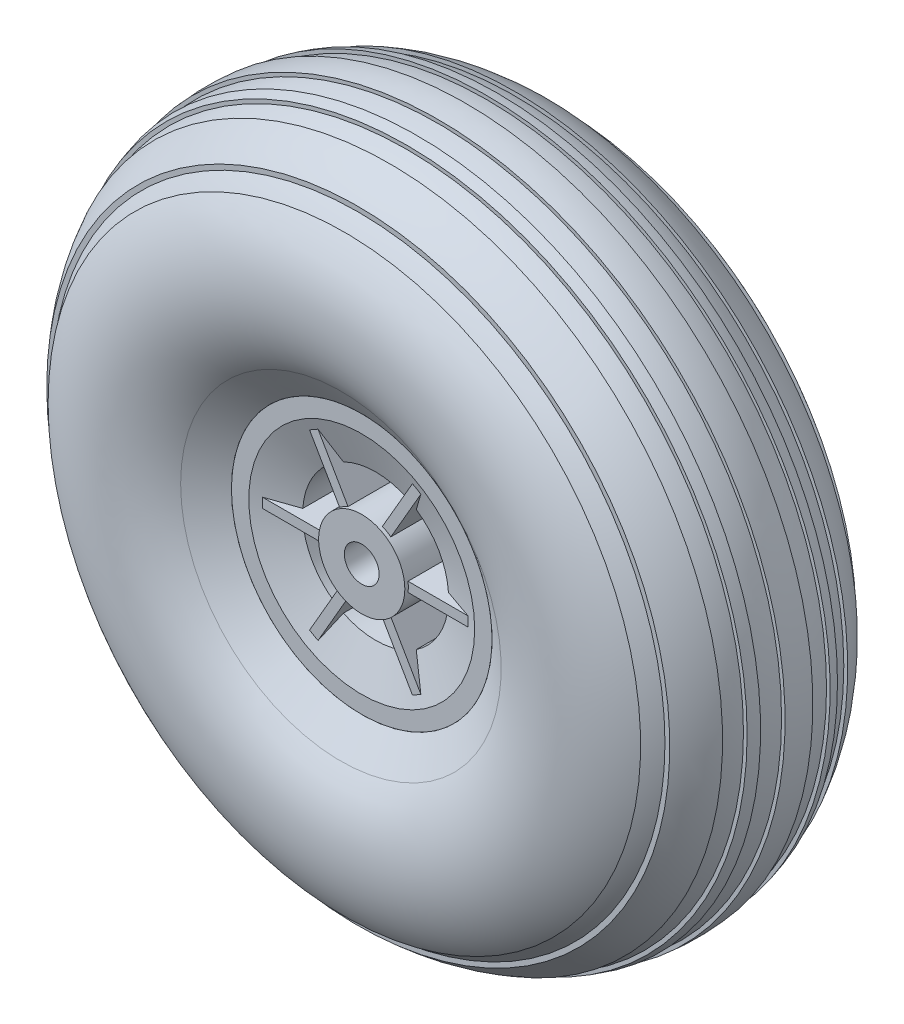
from build123d import *

# Parameters (mm, degrees)
BOSS_EXTRU_1_DEPTH           = 0.7
R_P_TITION_CIRCULAIRE1_COUNT = 6
SYM_TRIE1_COPY_1_DEPTH       = 0.7
SYM_TRIE1_COPY_2_DEPTH       = 0.7
SYM_TRIE1_COPY_3_DEPTH       = 0.7
SYM_TRIE1_COPY_4_DEPTH       = 0.7
SYM_TRIE1_COPY_5_DEPTH       = 0.7


with BuildPart() as part:
    # Esquisse1 → R_volution1 (revolve)
    with BuildSketch(Plane(origin=(0, 0, 0), x_dir=(0, 0, -1), z_dir=(1, 0, 0)), mode=Mode.PRIVATE) as r_volution1_sk:
        Polygon((13, 2.5), (-13, 2.5), (-13, 6.2), (-4, 6.2), (-4, 10.5), (-11, 10.5), (-13, 16.25), (-13, 18.75), (-12, 18.75), (-12, 16.418948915), (-10.289061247, 11.5), (10.289061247, 11.5), (12, 16.418948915), (12, 18.75), (13, 18.75), (13, 16.25), (11, 10.5), (4, 10.5), (4, 6.2), (13, 6.2), align=None)
    revolve(r_volution1_sk.sketch.rotate(Axis((0, 0, 0), (0, 0, -1)), 90), axis=Axis((0, 0, 0), (0, 0, -1)))

    # Esquisse2 → Boss.-Extru.1 (add, symmetric)
    with BuildSketch(Plane(origin=(0, 0, 0), x_dir=(1, 0, 0), z_dir=(0, 1, 0))):
        Polygon((4, 12.5), (4, 4), (10.5, 4), (10.5, 11), (14.8125, 12.5), align=None)
    boss_extru_1 = extrude(amount=BOSS_EXTRU_1_DEPTH, both=True)

    # R_p_tition circulaire1: Boss.-Extru.1 ×6 about axis
    r_p_tition_circulaire1_axis = Axis((0, 0, 0), (0, 0, 1))
    for i in range(1, R_P_TITION_CIRCULAIRE1_COUNT):
        add(boss_extru_1.rotate(r_p_tition_circulaire1_axis, i * 360 / R_P_TITION_CIRCULAIRE1_COUNT))

    # Sym_trie1: Boss.-Extru.1 across plane
    add(boss_extru_1.mirror(Plane.XY))

    # Sym_trie1 copy 1 sketch → Sym_trie1 copy 1 (add, symmetric)
    with BuildSketch(Plane(origin=(0, 0, 0), x_dir=(0.5000000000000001, 0.8660254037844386, 0), z_dir=(-0.8660254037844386, 0.5000000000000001, 0))):
        Polygon((4, -12.5), (4, -4), (10.5, -4), (10.5, -11), (14.8125, -12.5), align=None)
    extrude(amount=SYM_TRIE1_COPY_1_DEPTH, both=True)

    # Sym_trie1 copy 2 sketch → Sym_trie1 copy 2 (add, symmetric)
    with BuildSketch(Plane(origin=(0, 0, 0), x_dir=(-0.4999999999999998, 0.8660254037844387, 0), z_dir=(-0.8660254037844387, -0.4999999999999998, 0))):
        Polygon((4, -12.5), (4, -4), (10.5, -4), (10.5, -11), (14.8125, -12.5), align=None)
    extrude(amount=SYM_TRIE1_COPY_2_DEPTH, both=True)

    # Sym_trie1 copy 3 sketch → Sym_trie1 copy 3 (add, symmetric)
    with BuildSketch(Plane(origin=(0, 0, 0), x_dir=(-1, 0, 0), z_dir=(0, -1, 0))):
        Polygon((4, -12.5), (4, -4), (10.5, -4), (10.5, -11), (14.8125, -12.5), align=None)
    extrude(amount=SYM_TRIE1_COPY_3_DEPTH, both=True)

    # Sym_trie1 copy 4 sketch → Sym_trie1 copy 4 (add, symmetric)
    with BuildSketch(Plane(origin=(0, 0, 0), x_dir=(-0.5000000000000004, -0.8660254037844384, 0), z_dir=(0.8660254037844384, -0.5000000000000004, 0))):
        Polygon((4, -12.5), (4, -4), (10.5, -4), (10.5, -11), (14.8125, -12.5), align=None)
    extrude(amount=SYM_TRIE1_COPY_4_DEPTH, both=True)

    # Sym_trie1 copy 5 sketch → Sym_trie1 copy 5 (add, symmetric)
    with BuildSketch(Plane(origin=(0, 0, 0), x_dir=(0.5000000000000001, -0.8660254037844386, 0), z_dir=(0.8660254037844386, 0.5000000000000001, 0))):
        Polygon((4, -12.5), (4, -4), (10.5, -4), (10.5, -11), (14.8125, -12.5), align=None)
    extrude(amount=SYM_TRIE1_COPY_5_DEPTH, both=True)


with BuildPart() as body_2:
    # Esquisse3 → R_volution2 (revolve)
    with BuildSketch(Plane(origin=(0, 0, 0), x_dir=(0, 0, -1), z_dir=(1, 0, 0)), mode=Mode.PRIVATE) as r_volution2_sk:
        with BuildLine():
            Line((-15.99731509, 23.058158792), (-13, 18.75))
            Line((-13, 18.75), (-12, 18.75))
            Line((-12, 18.75), (-12, 16.418948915))
            Line((-12, 16.418948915), (-10.289061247, 11.5))
            Line((-10.289061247, 11.5), (10.289061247, 11.5))
            Line((10.289061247, 11.5), (12, 16.418948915))
            Line((12, 16.418948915), (12, 18.75))
            Line((12, 18.75), (13, 18.75))
            Line((13, 18.75), (15.99731509, 23.058158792))
            add(Edge.make_bspline(
                [(15.99731509, 23.058158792), (34.74156086, 50), (0, 50), (-34.74156086, 50), (-15.99731509, 23.058158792)],
                knots=[5.713302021, 5.713302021, 5.713302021, 7.853981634, 7.853981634, 9.994661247, 9.994661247, 9.994661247], degree=2, weights=[1, 0.479826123, 1, 0.479826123, 1]))
        make_face()
    revolve(r_volution2_sk.sketch.rotate(Axis((0, 0, 0), (0, 0, 1)), 90), axis=Axis((0, 0, 0), (0, 0, 1)))

    # Esquisse4 → Enl_vement de mati_re-R_volution3 (revolve, cut)
    with BuildSketch(Plane(origin=(0, 0, 0), x_dir=(0, 0, -1), z_dir=(1, 0, 0)), mode=Mode.PRIVATE) as enl_vement_de_mati_re_r_volution3_sk:
        with BuildLine():
            Line((2, 52.400365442), (2, 49.400365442))
            ThreePointArc((2, 49.400365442), (3.509754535, 49.1887515), (5, 48.86733639))
            Line((5, 48.86733639), (5, 52.400365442))
            Line((5, 52.400365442), (2, 52.400365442))
        make_face()
        with BuildLine():
            Line((6.5, 52.400365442), (6.5, 48.416142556))
            ThreePointArc((6.5, 48.416142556), (7.771969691, 47.936067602), (9, 47.352697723))
            Line((9, 47.352697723), (9, 52.400365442))
            Line((9, 52.400365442), (6.5, 52.400365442))
        make_face()
        with BuildLine():
            Line((13.5, 44.123507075), (13.5, 52.400365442))
            Line((13.5, 52.400365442), (15.5, 52.400365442))
            Line((15.5, 52.400365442), (15.5, 41.78062616))
            ThreePointArc((15.5, 41.78062616), (14.55223569, 42.996657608), (13.5, 44.123507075))
        make_face()
    enl_vement_de_mati_re_r_volution3 = revolve(enl_vement_de_mati_re_r_volution3_sk.sketch.rotate(Axis((0, 0, 0), (0, 0, -1)), 90), axis=Axis((0, 0, 0), (0, 0, -1)), mode=Mode.SUBTRACT)

    # Sym_trie2: Enl_vement de mati_re-R_volution3 across plane
    add(enl_vement_de_mati_re_r_volution3.mirror(Plane.XY), mode=Mode.SUBTRACT)


solid = Compound([part.part, body_2.part])
